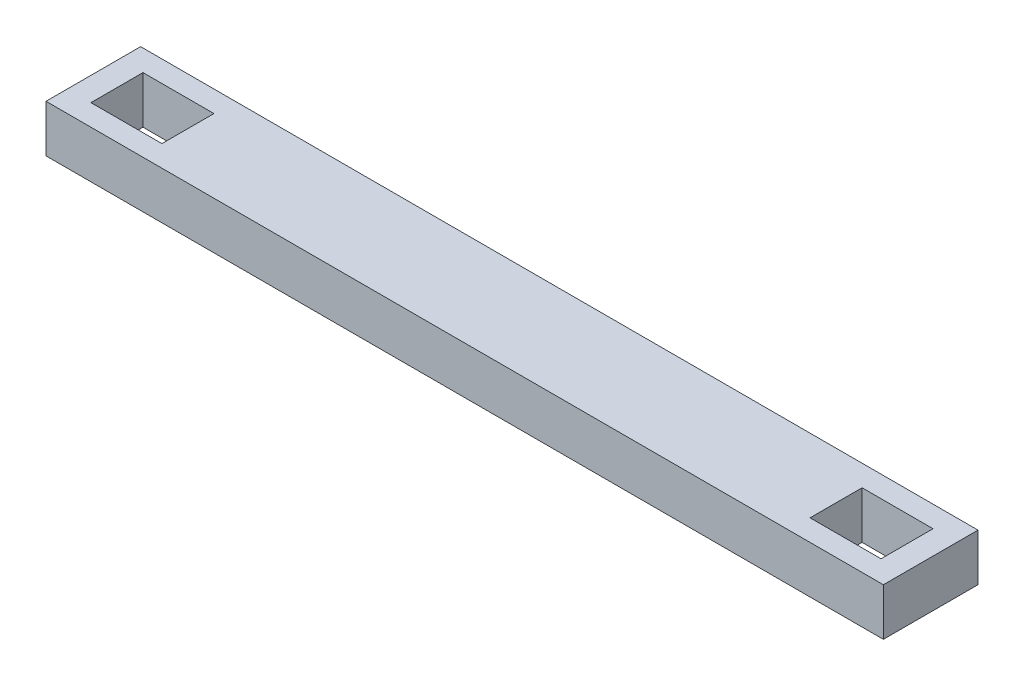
ISO-10303-21;
HEADER;
FILE_DESCRIPTION(('STEP AP214'),'2;1');
FILE_NAME('part.step','',(''),(''),'','','');
FILE_SCHEMA(('AUTOMOTIVE_DESIGN { 1 0 10303 214 1 1 1 1 }'));
ENDSEC;
DATA;
#1=APPLICATION_CONTEXT('core data for automotive mechanical design processes');
#2=APPLICATION_PROTOCOL_DEFINITION('international standard','automotive_design',2000,#1);
#3=PRODUCT_CONTEXT('',#1,'mechanical');
#4=PRODUCT('Part','Part','',(#3));
#5=PRODUCT_RELATED_PRODUCT_CATEGORY('part','',(#4));
#6=PRODUCT_DEFINITION_FORMATION('','',#4);
#7=PRODUCT_DEFINITION_CONTEXT('part definition',#1,'design');
#8=PRODUCT_DEFINITION('design','',#6,#7);
#9=PRODUCT_DEFINITION_SHAPE('','',#8);
#10=(LENGTH_UNIT() NAMED_UNIT(*) SI_UNIT(.MILLI.,.METRE.));
#11=(NAMED_UNIT(*) PLANE_ANGLE_UNIT() SI_UNIT($,.RADIAN.));
#12=(NAMED_UNIT(*) SI_UNIT($,.STERADIAN.) SOLID_ANGLE_UNIT());
#13=UNCERTAINTY_MEASURE_WITH_UNIT(LENGTH_MEASURE(1.E-05),#10,'distance_accuracy_value','');
#14=(GEOMETRIC_REPRESENTATION_CONTEXT(3) GLOBAL_UNCERTAINTY_ASSIGNED_CONTEXT((#13)) GLOBAL_UNIT_ASSIGNED_CONTEXT((#10,
#11,#12)) REPRESENTATION_CONTEXT('',''));
#15=CARTESIAN_POINT('',(0.,0.,0.));
#16=DIRECTION('',(0.,0.,1.));
#17=DIRECTION('',(1.,0.,0.));
#18=AXIS2_PLACEMENT_3D('',#15,#16,#17);
#19=CARTESIAN_POINT('',(0.,10.,-5.49999999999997));
#20=DIRECTION('',(0.,0.,1.));
#21=DIRECTION('',(1.,0.,0.));
#22=AXIS2_PLACEMENT_3D('',#19,#20,#21);
#23=PLANE('',#22);
#24=DIRECTION('',(-1.,0.,0.));
#25=VECTOR('',#24,1.);
#26=CARTESIAN_POINT('',(0.,0.,-5.49999999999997));
#27=LINE('',#26,#25);
#28=CARTESIAN_POINT('',(159.5,0.,-5.50000000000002));
#29=VERTEX_POINT('',#28);
#30=CARTESIAN_POINT('',(144.5,0.,-5.50000000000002));
#31=VERTEX_POINT('',#30);
#32=EDGE_CURVE('E235',#29,#31,#27,.T.);
#33=ORIENTED_EDGE('',*,*,#32,.F.);
#34=DIRECTION('',(0.,-1.,0.));
#35=VECTOR('',#34,1.);
#36=CARTESIAN_POINT('',(159.5,10.,-5.50000000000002));
#37=LINE('',#36,#35);
#38=CARTESIAN_POINT('',(159.5,10.,-5.50000000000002));
#39=VERTEX_POINT('',#38);
#40=EDGE_CURVE('E11',#39,#29,#37,.T.);
#41=ORIENTED_EDGE('',*,*,#40,.F.);
#42=DIRECTION('',(-1.,0.,0.));
#43=VECTOR('',#42,1.);
#44=CARTESIAN_POINT('',(0.,10.,-5.49999999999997));
#45=LINE('',#44,#43);
#46=CARTESIAN_POINT('',(144.5,10.,-5.50000000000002));
#47=VERTEX_POINT('',#46);
#48=EDGE_CURVE('E152',#39,#47,#45,.T.);
#49=ORIENTED_EDGE('',*,*,#48,.T.);
#50=DIRECTION('',(0.,-1.,0.));
#51=VECTOR('',#50,1.);
#52=CARTESIAN_POINT('',(144.5,10.,-5.50000000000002));
#53=LINE('',#52,#51);
#54=EDGE_CURVE('E60',#47,#31,#53,.T.);
#55=ORIENTED_EDGE('',*,*,#54,.T.);
#56=EDGE_LOOP('',(#33,#41,#49,#55));
#57=FACE_BOUND('',#56,.T.);
#58=ADVANCED_FACE('F40',(#57),#23,.T.);
#59=CARTESIAN_POINT('',(159.5,10.,4.02455846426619E-13));
#60=DIRECTION('',(1.,0.,0.));
#61=DIRECTION('',(0.,0.,-1.));
#62=AXIS2_PLACEMENT_3D('',#59,#60,#61);
#63=PLANE('',#62);
#64=DIRECTION('',(0.,0.,1.));
#65=VECTOR('',#64,1.);
#66=CARTESIAN_POINT('',(159.5,0.,4.02455846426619E-13));
#67=LINE('',#66,#65);
#68=CARTESIAN_POINT('',(159.5,0.,5.49999999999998));
#69=VERTEX_POINT('',#68);
#70=EDGE_CURVE('E158',#29,#69,#67,.T.);
#71=ORIENTED_EDGE('',*,*,#70,.T.);
#72=DIRECTION('',(0.,-1.,0.));
#73=VECTOR('',#72,1.);
#74=CARTESIAN_POINT('',(159.5,10.,5.49999999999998));
#75=LINE('',#74,#73);
#76=CARTESIAN_POINT('',(159.5,10.,5.49999999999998));
#77=VERTEX_POINT('',#76);
#78=EDGE_CURVE('E51',#77,#69,#75,.T.);
#79=ORIENTED_EDGE('',*,*,#78,.F.);
#80=DIRECTION('',(0.,0.,1.));
#81=VECTOR('',#80,1.);
#82=CARTESIAN_POINT('',(159.5,10.,4.02455846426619E-13));
#83=LINE('',#82,#81);
#84=EDGE_CURVE('E147',#39,#77,#83,.T.);
#85=ORIENTED_EDGE('',*,*,#84,.F.);
#86=ORIENTED_EDGE('',*,*,#40,.T.);
#87=EDGE_LOOP('',(#71,#79,#85,#86));
#88=FACE_BOUND('',#87,.T.);
#89=ADVANCED_FACE('F156',(#88),#63,.F.);
#90=CARTESIAN_POINT('',(0.,10.,5.50000000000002));
#91=DIRECTION('',(0.,0.,1.));
#92=DIRECTION('',(1.,0.,0.));
#93=AXIS2_PLACEMENT_3D('',#90,#91,#92);
#94=PLANE('',#93);
#95=DIRECTION('',(-1.,0.,0.));
#96=VECTOR('',#95,1.);
#97=CARTESIAN_POINT('',(0.,0.,5.50000000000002));
#98=LINE('',#97,#96);
#99=CARTESIAN_POINT('',(144.5,0.,5.49999999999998));
#100=VERTEX_POINT('',#99);
#101=EDGE_CURVE('E240',#69,#100,#98,.T.);
#102=ORIENTED_EDGE('',*,*,#101,.T.);
#103=DIRECTION('',(0.,-1.,0.));
#104=VECTOR('',#103,1.);
#105=CARTESIAN_POINT('',(144.5,10.,5.49999999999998));
#106=LINE('',#105,#104);
#107=CARTESIAN_POINT('',(144.5,10.,5.49999999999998));
#108=VERTEX_POINT('',#107);
#109=EDGE_CURVE('E98',#108,#100,#106,.T.);
#110=ORIENTED_EDGE('',*,*,#109,.F.);
#111=DIRECTION('',(-1.,0.,0.));
#112=VECTOR('',#111,1.);
#113=CARTESIAN_POINT('',(0.,10.,5.50000000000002));
#114=LINE('',#113,#112);
#115=EDGE_CURVE('E138',#77,#108,#114,.T.);
#116=ORIENTED_EDGE('',*,*,#115,.F.);
#117=ORIENTED_EDGE('',*,*,#78,.T.);
#118=EDGE_LOOP('',(#102,#110,#116,#117));
#119=FACE_BOUND('',#118,.T.);
#120=ADVANCED_FACE('F140',(#119),#94,.F.);
#121=CARTESIAN_POINT('',(0.,10.,-5.5));
#122=DIRECTION('',(0.,0.,-1.));
#123=DIRECTION('',(-1.,0.,0.));
#124=AXIS2_PLACEMENT_3D('',#121,#122,#123);
#125=PLANE('',#124);
#126=DIRECTION('',(1.,0.,0.));
#127=VECTOR('',#126,1.);
#128=CARTESIAN_POINT('',(0.,0.,-5.5));
#129=LINE('',#128,#127);
#130=CARTESIAN_POINT('',(-7.5,0.,-5.5));
#131=VERTEX_POINT('',#130);
#132=CARTESIAN_POINT('',(7.5,0.,-5.5));
#133=VERTEX_POINT('',#132);
#134=EDGE_CURVE('E219',#131,#133,#129,.T.);
#135=ORIENTED_EDGE('',*,*,#134,.T.);
#136=DIRECTION('',(0.,-1.,0.));
#137=VECTOR('',#136,1.);
#138=CARTESIAN_POINT('',(7.5,10.,-5.5));
#139=LINE('',#138,#137);
#140=CARTESIAN_POINT('',(7.5,10.,-5.5));
#141=VERTEX_POINT('',#140);
#142=EDGE_CURVE('E174',#141,#133,#139,.T.);
#143=ORIENTED_EDGE('',*,*,#142,.F.);
#144=DIRECTION('',(1.,0.,0.));
#145=VECTOR('',#144,1.);
#146=CARTESIAN_POINT('',(0.,10.,-5.5));
#147=LINE('',#146,#145);
#148=CARTESIAN_POINT('',(-7.5,10.,-5.5));
#149=VERTEX_POINT('',#148);
#150=EDGE_CURVE('E259',#149,#141,#147,.T.);
#151=ORIENTED_EDGE('',*,*,#150,.F.);
#152=DIRECTION('',(0.,-1.,0.));
#153=VECTOR('',#152,1.);
#154=CARTESIAN_POINT('',(-7.5,10.,-5.5));
#155=LINE('',#154,#153);
#156=EDGE_CURVE('E165',#149,#131,#155,.T.);
#157=ORIENTED_EDGE('',*,*,#156,.T.);
#158=EDGE_LOOP('',(#135,#143,#151,#157));
#159=FACE_BOUND('',#158,.T.);
#160=ADVANCED_FACE('F308',(#159),#125,.F.);
#161=CARTESIAN_POINT('',(7.5,10.,0.));
#162=DIRECTION('',(1.,0.,0.));
#163=DIRECTION('',(0.,0.,-1.));
#164=AXIS2_PLACEMENT_3D('',#161,#162,#163);
#165=PLANE('',#164);
#166=DIRECTION('',(0.,0.,1.));
#167=VECTOR('',#166,1.);
#168=CARTESIAN_POINT('',(7.5,0.,0.));
#169=LINE('',#168,#167);
#170=CARTESIAN_POINT('',(7.5,0.,5.5));
#171=VERTEX_POINT('',#170);
#172=EDGE_CURVE('E223',#133,#171,#169,.T.);
#173=ORIENTED_EDGE('',*,*,#172,.T.);
#174=DIRECTION('',(0.,-1.,0.));
#175=VECTOR('',#174,1.);
#176=CARTESIAN_POINT('',(7.5,10.,5.5));
#177=LINE('',#176,#175);
#178=CARTESIAN_POINT('',(7.5,10.,5.5));
#179=VERTEX_POINT('',#178);
#180=EDGE_CURVE('E171',#179,#171,#177,.T.);
#181=ORIENTED_EDGE('',*,*,#180,.F.);
#182=DIRECTION('',(0.,0.,1.));
#183=VECTOR('',#182,1.);
#184=CARTESIAN_POINT('',(7.5,10.,0.));
#185=LINE('',#184,#183);
#186=EDGE_CURVE('E263',#141,#179,#185,.T.);
#187=ORIENTED_EDGE('',*,*,#186,.F.);
#188=ORIENTED_EDGE('',*,*,#142,.T.);
#189=EDGE_LOOP('',(#173,#181,#187,#188));
#190=FACE_BOUND('',#189,.T.);
#191=ADVANCED_FACE('F304',(#190),#165,.F.);
#192=CARTESIAN_POINT('',(0.,10.,5.5));
#193=DIRECTION('',(0.,0.,-1.));
#194=DIRECTION('',(-1.,0.,0.));
#195=AXIS2_PLACEMENT_3D('',#192,#193,#194);
#196=PLANE('',#195);
#197=DIRECTION('',(1.,0.,0.));
#198=VECTOR('',#197,1.);
#199=CARTESIAN_POINT('',(0.,0.,5.5));
#200=LINE('',#199,#198);
#201=CARTESIAN_POINT('',(-7.5,0.,5.5));
#202=VERTEX_POINT('',#201);
#203=EDGE_CURVE('E227',#202,#171,#200,.T.);
#204=ORIENTED_EDGE('',*,*,#203,.F.);
#205=DIRECTION('',(0.,-1.,0.));
#206=VECTOR('',#205,1.);
#207=CARTESIAN_POINT('',(-7.5,10.,5.5));
#208=LINE('',#207,#206);
#209=CARTESIAN_POINT('',(-7.5,10.,5.5));
#210=VERTEX_POINT('',#209);
#211=EDGE_CURVE('E168',#210,#202,#208,.T.);
#212=ORIENTED_EDGE('',*,*,#211,.F.);
#213=DIRECTION('',(1.,0.,0.));
#214=VECTOR('',#213,1.);
#215=CARTESIAN_POINT('',(0.,10.,5.5));
#216=LINE('',#215,#214);
#217=EDGE_CURVE('E266',#210,#179,#216,.T.);
#218=ORIENTED_EDGE('',*,*,#217,.T.);
#219=ORIENTED_EDGE('',*,*,#180,.T.);
#220=EDGE_LOOP('',(#204,#212,#218,#219));
#221=FACE_BOUND('',#220,.T.);
#222=ADVANCED_FACE('F301',(#221),#196,.T.);
#223=CARTESIAN_POINT('',(0.,10.,10.));
#224=DIRECTION('',(0.,0.,-1.));
#225=DIRECTION('',(-1.,0.,0.));
#226=AXIS2_PLACEMENT_3D('',#223,#224,#225);
#227=PLANE('',#226);
#228=DIRECTION('',(1.,0.,0.));
#229=VECTOR('',#228,1.);
#230=CARTESIAN_POINT('',(0.,0.,10.));
#231=LINE('',#230,#229);
#232=CARTESIAN_POINT('',(-12.5,0.,10.));
#233=VERTEX_POINT('',#232);
#234=CARTESIAN_POINT('',(164.5,0.,9.99999999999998));
#235=VERTEX_POINT('',#234);
#236=EDGE_CURVE('E201',#233,#235,#231,.T.);
#237=ORIENTED_EDGE('',*,*,#236,.T.);
#238=DIRECTION('',(0.,-1.,0.));
#239=VECTOR('',#238,1.);
#240=CARTESIAN_POINT('',(164.5,10.,9.99999999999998));
#241=LINE('',#240,#239);
#242=CARTESIAN_POINT('',(164.5,10.,9.99999999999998));
#243=VERTEX_POINT('',#242);
#244=EDGE_CURVE('E44',#243,#235,#241,.T.);
#245=ORIENTED_EDGE('',*,*,#244,.F.);
#246=DIRECTION('',(1.,0.,0.));
#247=VECTOR('',#246,1.);
#248=CARTESIAN_POINT('',(0.,10.,10.));
#249=LINE('',#248,#247);
#250=CARTESIAN_POINT('',(-12.5,10.,10.));
#251=VERTEX_POINT('',#250);
#252=EDGE_CURVE('E111',#251,#243,#249,.T.);
#253=ORIENTED_EDGE('',*,*,#252,.F.);
#254=DIRECTION('',(0.,-1.,0.));
#255=VECTOR('',#254,1.);
#256=CARTESIAN_POINT('',(-12.5,10.,10.));
#257=LINE('',#256,#255);
#258=EDGE_CURVE('E178',#251,#233,#257,.T.);
#259=ORIENTED_EDGE('',*,*,#258,.T.);
#260=EDGE_LOOP('',(#237,#245,#253,#259));
#261=FACE_BOUND('',#260,.T.);
#262=ADVANCED_FACE('F42',(#261),#227,.F.);
#263=CARTESIAN_POINT('',(164.5,10.,2.28289609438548E-13));
#264=DIRECTION('',(1.,0.,0.));
#265=DIRECTION('',(0.,0.,-1.));
#266=AXIS2_PLACEMENT_3D('',#263,#264,#265);
#267=PLANE('',#266);
#268=DIRECTION('',(0.,0.,1.));
#269=VECTOR('',#268,1.);
#270=CARTESIAN_POINT('',(164.5,0.,2.28289609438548E-13));
#271=LINE('',#270,#269);
#272=CARTESIAN_POINT('',(164.5,0.,-10.));
#273=VERTEX_POINT('',#272);
#274=EDGE_CURVE('E196',#273,#235,#271,.T.);
#275=ORIENTED_EDGE('',*,*,#274,.F.);
#276=DIRECTION('',(0.,-1.,0.));
#277=VECTOR('',#276,1.);
#278=CARTESIAN_POINT('',(164.5,10.,-10.));
#279=LINE('',#278,#277);
#280=CARTESIAN_POINT('',(164.5,10.,-10.));
#281=VERTEX_POINT('',#280);
#282=EDGE_CURVE('E184',#281,#273,#279,.T.);
#283=ORIENTED_EDGE('',*,*,#282,.F.);
#284=DIRECTION('',(0.,0.,1.));
#285=VECTOR('',#284,1.);
#286=CARTESIAN_POINT('',(164.5,10.,2.28289609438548E-13));
#287=LINE('',#286,#285);
#288=EDGE_CURVE('E198',#281,#243,#287,.T.);
#289=ORIENTED_EDGE('',*,*,#288,.T.);
#290=ORIENTED_EDGE('',*,*,#244,.T.);
#291=EDGE_LOOP('',(#275,#283,#289,#290));
#292=FACE_BOUND('',#291,.T.);
#293=ADVANCED_FACE('F194',(#292),#267,.T.);
#294=CARTESIAN_POINT('',(0.,10.,-10.));
#295=DIRECTION('',(0.,0.,-1.));
#296=DIRECTION('',(-1.,0.,0.));
#297=AXIS2_PLACEMENT_3D('',#294,#295,#296);
#298=PLANE('',#297);
#299=DIRECTION('',(1.,0.,0.));
#300=VECTOR('',#299,1.);
#301=CARTESIAN_POINT('',(0.,0.,-10.));
#302=LINE('',#301,#300);
#303=CARTESIAN_POINT('',(-12.5,0.,-10.));
#304=VERTEX_POINT('',#303);
#305=EDGE_CURVE('E209',#304,#273,#302,.T.);
#306=ORIENTED_EDGE('',*,*,#305,.F.);
#307=DIRECTION('',(0.,-1.,0.));
#308=VECTOR('',#307,1.);
#309=CARTESIAN_POINT('',(-12.5,10.,-10.));
#310=LINE('',#309,#308);
#311=CARTESIAN_POINT('',(-12.5,10.,-10.));
#312=VERTEX_POINT('',#311);
#313=EDGE_CURVE('E182',#312,#304,#310,.T.);
#314=ORIENTED_EDGE('',*,*,#313,.F.);
#315=DIRECTION('',(1.,0.,0.));
#316=VECTOR('',#315,1.);
#317=CARTESIAN_POINT('',(0.,10.,-10.));
#318=LINE('',#317,#316);
#319=EDGE_CURVE('E251',#312,#281,#318,.T.);
#320=ORIENTED_EDGE('',*,*,#319,.T.);
#321=ORIENTED_EDGE('',*,*,#282,.T.);
#322=EDGE_LOOP('',(#306,#314,#320,#321));
#323=FACE_BOUND('',#322,.T.);
#324=ADVANCED_FACE('F299',(#323),#298,.T.);
#325=CARTESIAN_POINT('',(-7.5,10.,0.));
#326=DIRECTION('',(1.,0.,0.));
#327=DIRECTION('',(0.,0.,-1.));
#328=AXIS2_PLACEMENT_3D('',#325,#326,#327);
#329=PLANE('',#328);
#330=DIRECTION('',(0.,0.,1.));
#331=VECTOR('',#330,1.);
#332=CARTESIAN_POINT('',(-7.5,0.,0.));
#333=LINE('',#332,#331);
#334=EDGE_CURVE('E231',#131,#202,#333,.T.);
#335=ORIENTED_EDGE('',*,*,#334,.F.);
#336=ORIENTED_EDGE('',*,*,#156,.F.);
#337=DIRECTION('',(0.,0.,1.));
#338=VECTOR('',#337,1.);
#339=CARTESIAN_POINT('',(-7.5,10.,0.));
#340=LINE('',#339,#338);
#341=EDGE_CURVE('E270',#149,#210,#340,.T.);
#342=ORIENTED_EDGE('',*,*,#341,.T.);
#343=ORIENTED_EDGE('',*,*,#211,.T.);
#344=EDGE_LOOP('',(#335,#336,#342,#343));
#345=FACE_BOUND('',#344,.T.);
#346=ADVANCED_FACE('F285',(#345),#329,.T.);
#347=CARTESIAN_POINT('',(-12.5,10.,0.));
#348=DIRECTION('',(1.,0.,0.));
#349=DIRECTION('',(0.,0.,-1.));
#350=AXIS2_PLACEMENT_3D('',#347,#348,#349);
#351=PLANE('',#350);
#352=DIRECTION('',(0.,0.,1.));
#353=VECTOR('',#352,1.);
#354=CARTESIAN_POINT('',(-12.5,0.,0.));
#355=LINE('',#354,#353);
#356=EDGE_CURVE('E213',#304,#233,#355,.T.);
#357=ORIENTED_EDGE('',*,*,#356,.T.);
#358=ORIENTED_EDGE('',*,*,#258,.F.);
#359=DIRECTION('',(0.,0.,1.));
#360=VECTOR('',#359,1.);
#361=CARTESIAN_POINT('',(-12.5,10.,0.));
#362=LINE('',#361,#360);
#363=EDGE_CURVE('E256',#312,#251,#362,.T.);
#364=ORIENTED_EDGE('',*,*,#363,.F.);
#365=ORIENTED_EDGE('',*,*,#313,.T.);
#366=EDGE_LOOP('',(#357,#358,#364,#365));
#367=FACE_BOUND('',#366,.T.);
#368=ADVANCED_FACE('F278',(#367),#351,.F.);
#369=CARTESIAN_POINT('',(144.5,10.,0.));
#370=DIRECTION('',(1.,0.,0.));
#371=DIRECTION('',(0.,0.,-1.));
#372=AXIS2_PLACEMENT_3D('',#369,#370,#371);
#373=PLANE('',#372);
#374=DIRECTION('',(0.,0.,1.));
#375=VECTOR('',#374,1.);
#376=CARTESIAN_POINT('',(144.5,0.,0.));
#377=LINE('',#376,#375);
#378=EDGE_CURVE('E243',#31,#100,#377,.T.);
#379=ORIENTED_EDGE('',*,*,#378,.F.);
#380=ORIENTED_EDGE('',*,*,#54,.F.);
#381=DIRECTION('',(0.,0.,1.));
#382=VECTOR('',#381,1.);
#383=CARTESIAN_POINT('',(144.5,10.,0.));
#384=LINE('',#383,#382);
#385=EDGE_CURVE('E146',#47,#108,#384,.T.);
#386=ORIENTED_EDGE('',*,*,#385,.T.);
#387=ORIENTED_EDGE('',*,*,#109,.T.);
#388=EDGE_LOOP('',(#379,#380,#386,#387));
#389=FACE_BOUND('',#388,.T.);
#390=ADVANCED_FACE('F276',(#389),#373,.T.);
#391=CARTESIAN_POINT('',(0.,10.,0.));
#392=DIRECTION('',(0.,1.,0.));
#393=DIRECTION('',(0.,0.,1.));
#394=AXIS2_PLACEMENT_3D('',#391,#392,#393);
#395=PLANE('',#394);
#396=ORIENTED_EDGE('',*,*,#252,.T.);
#397=ORIENTED_EDGE('',*,*,#288,.F.);
#398=ORIENTED_EDGE('',*,*,#319,.F.);
#399=ORIENTED_EDGE('',*,*,#363,.T.);
#400=EDGE_LOOP('',(#396,#397,#398,#399));
#401=FACE_BOUND('',#400,.T.);
#402=ORIENTED_EDGE('',*,*,#150,.T.);
#403=ORIENTED_EDGE('',*,*,#186,.T.);
#404=ORIENTED_EDGE('',*,*,#217,.F.);
#405=ORIENTED_EDGE('',*,*,#341,.F.);
#406=EDGE_LOOP('',(#402,#403,#404,#405));
#407=FACE_BOUND('',#406,.T.);
#408=ORIENTED_EDGE('',*,*,#48,.F.);
#409=ORIENTED_EDGE('',*,*,#84,.T.);
#410=ORIENTED_EDGE('',*,*,#115,.T.);
#411=ORIENTED_EDGE('',*,*,#385,.F.);
#412=EDGE_LOOP('',(#408,#409,#410,#411));
#413=FACE_BOUND('',#412,.T.);
#414=ADVANCED_FACE('F151',(#401,#407,#413),#395,.T.);
#415=CARTESIAN_POINT('',(0.,0.,0.));
#416=DIRECTION('',(0.,1.,0.));
#417=DIRECTION('',(0.,0.,1.));
#418=AXIS2_PLACEMENT_3D('',#415,#416,#417);
#419=PLANE('',#418);
#420=ORIENTED_EDGE('',*,*,#236,.F.);
#421=ORIENTED_EDGE('',*,*,#356,.F.);
#422=ORIENTED_EDGE('',*,*,#305,.T.);
#423=ORIENTED_EDGE('',*,*,#274,.T.);
#424=EDGE_LOOP('',(#420,#421,#422,#423));
#425=FACE_BOUND('',#424,.T.);
#426=ORIENTED_EDGE('',*,*,#134,.F.);
#427=ORIENTED_EDGE('',*,*,#334,.T.);
#428=ORIENTED_EDGE('',*,*,#203,.T.);
#429=ORIENTED_EDGE('',*,*,#172,.F.);
#430=EDGE_LOOP('',(#426,#427,#428,#429));
#431=FACE_BOUND('',#430,.T.);
#432=ORIENTED_EDGE('',*,*,#32,.T.);
#433=ORIENTED_EDGE('',*,*,#378,.T.);
#434=ORIENTED_EDGE('',*,*,#101,.F.);
#435=ORIENTED_EDGE('',*,*,#70,.F.);
#436=EDGE_LOOP('',(#432,#433,#434,#435));
#437=FACE_BOUND('',#436,.T.);
#438=ADVANCED_FACE('F207',(#425,#431,#437),#419,.F.);
#439=CLOSED_SHELL('',(#58,#89,#120,#160,#191,#222,#262,#293,#324,#346,#368,#390,#414,#438));
#440=MANIFOLD_SOLID_BREP('B2',#439);
#441=ADVANCED_BREP_SHAPE_REPRESENTATION('',(#18,#440),#14);
#442=SHAPE_DEFINITION_REPRESENTATION(#9,#441);
ENDSEC;
END-ISO-10303-21;
